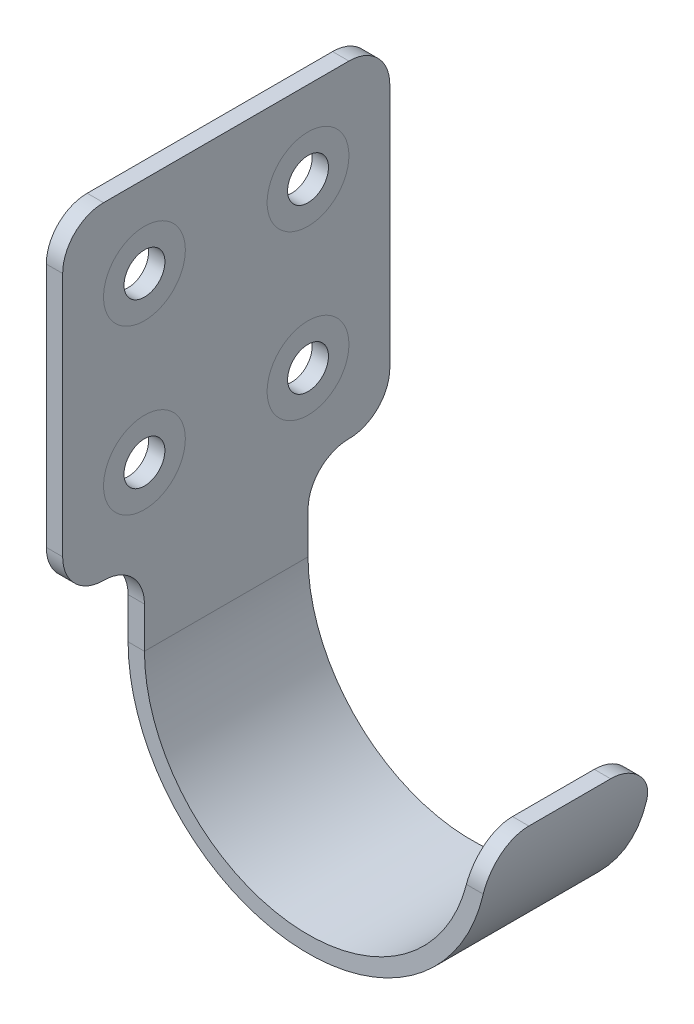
ISO-10303-21;
HEADER;
FILE_DESCRIPTION(('STEP AP214'),'2;1');
FILE_NAME('part.step','',(''),(''),'','','');
FILE_SCHEMA(('AUTOMOTIVE_DESIGN { 1 0 10303 214 1 1 1 1 }'));
ENDSEC;
DATA;
#1=APPLICATION_CONTEXT('core data for automotive mechanical design processes');
#2=APPLICATION_PROTOCOL_DEFINITION('international standard','automotive_design',2000,#1);
#3=PRODUCT_CONTEXT('',#1,'mechanical');
#4=PRODUCT('Part','Part','',(#3));
#5=PRODUCT_RELATED_PRODUCT_CATEGORY('part','',(#4));
#6=PRODUCT_DEFINITION_FORMATION('','',#4);
#7=PRODUCT_DEFINITION_CONTEXT('part definition',#1,'design');
#8=PRODUCT_DEFINITION('design','',#6,#7);
#9=PRODUCT_DEFINITION_SHAPE('','',#8);
#10=(LENGTH_UNIT() NAMED_UNIT(*) SI_UNIT(.MILLI.,.METRE.));
#11=(NAMED_UNIT(*) PLANE_ANGLE_UNIT() SI_UNIT($,.RADIAN.));
#12=(NAMED_UNIT(*) SI_UNIT($,.STERADIAN.) SOLID_ANGLE_UNIT());
#13=UNCERTAINTY_MEASURE_WITH_UNIT(LENGTH_MEASURE(1.E-05),#10,'distance_accuracy_value','');
#14=(GEOMETRIC_REPRESENTATION_CONTEXT(3) GLOBAL_UNCERTAINTY_ASSIGNED_CONTEXT((#13)) GLOBAL_UNIT_ASSIGNED_CONTEXT((#10,
#11,#12)) REPRESENTATION_CONTEXT('',''));
#15=CARTESIAN_POINT('',(0.,0.,0.));
#16=DIRECTION('',(0.,0.,1.));
#17=DIRECTION('',(1.,0.,0.));
#18=AXIS2_PLACEMENT_3D('',#15,#16,#17);
#19=CARTESIAN_POINT('',(0.,0.,20.));
#20=DIRECTION('',(1.,0.,0.));
#21=DIRECTION('',(0.,0.,-1.));
#22=AXIS2_PLACEMENT_3D('',#19,#20,#21);
#23=PLANE('',#22);
#24=CARTESIAN_POINT('',(0.,40.,20.));
#25=DIRECTION('',(1.,0.,0.));
#26=DIRECTION('',(0.,0.,-1.));
#27=AXIS2_PLACEMENT_3D('',#24,#25,#26);
#28=CIRCLE('',#27,10.);
#29=CARTESIAN_POINT('',(0.,40.,9.99999999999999));
#30=VERTEX_POINT('',#29);
#31=EDGE_CURVE('E456',#30,#30,#28,.F.);
#32=ORIENTED_EDGE('',*,*,#31,.T.);
#33=EDGE_LOOP('',(#32));
#34=FACE_BOUND('',#33,.T.);
#35=CARTESIAN_POINT('',(0.,80.,20.));
#36=DIRECTION('',(1.,0.,0.));
#37=DIRECTION('',(0.,0.,-1.));
#38=AXIS2_PLACEMENT_3D('',#35,#36,#37);
#39=CIRCLE('',#38,10.);
#40=CARTESIAN_POINT('',(0.,80.,10.));
#41=VERTEX_POINT('',#40);
#42=EDGE_CURVE('E434',#41,#41,#39,.F.);
#43=ORIENTED_EDGE('',*,*,#42,.T.);
#44=EDGE_LOOP('',(#43));
#45=FACE_BOUND('',#44,.T.);
#46=DIRECTION('',(0.,-1.,0.));
#47=VECTOR('',#46,1.);
#48=CARTESIAN_POINT('',(0.,20.,40.));
#49=LINE('',#48,#47);
#50=CARTESIAN_POINT('',(0.,90.,40.));
#51=VERTEX_POINT('',#50);
#52=CARTESIAN_POINT('',(0.,30.,40.));
#53=VERTEX_POINT('',#52);
#54=EDGE_CURVE('E381',#51,#53,#49,.T.);
#55=ORIENTED_EDGE('',*,*,#54,.T.);
#56=CARTESIAN_POINT('',(0.,30.,30.));
#57=DIRECTION('',(1.,0.,0.));
#58=DIRECTION('',(0.,0.,-1.));
#59=AXIS2_PLACEMENT_3D('',#56,#57,#58);
#60=CIRCLE('',#59,10.);
#61=CARTESIAN_POINT('',(0.,20.,30.));
#62=VERTEX_POINT('',#61);
#63=EDGE_CURVE('E386',#53,#62,#60,.T.);
#64=ORIENTED_EDGE('',*,*,#63,.T.);
#65=CARTESIAN_POINT('',(0.,10.,30.));
#66=DIRECTION('',(1.,0.,0.));
#67=DIRECTION('',(0.,0.,-1.));
#68=AXIS2_PLACEMENT_3D('',#65,#66,#67);
#69=CIRCLE('',#68,10.);
#70=CARTESIAN_POINT('',(0.,10.,20.));
#71=VERTEX_POINT('',#70);
#72=EDGE_CURVE('E161',#62,#71,#69,.F.);
#73=ORIENTED_EDGE('',*,*,#72,.T.);
#74=DIRECTION('',(0.,-1.,0.));
#75=VECTOR('',#74,1.);
#76=CARTESIAN_POINT('',(0.,0.,20.));
#77=LINE('',#76,#75);
#78=CARTESIAN_POINT('',(0.,0.,20.));
#79=VERTEX_POINT('',#78);
#80=EDGE_CURVE('E152',#71,#79,#77,.T.);
#81=ORIENTED_EDGE('',*,*,#80,.T.);
#82=DIRECTION('',(0.,0.,-1.));
#83=VECTOR('',#82,1.);
#84=CARTESIAN_POINT('',(0.,0.,20.));
#85=LINE('',#84,#83);
#86=CARTESIAN_POINT('',(0.,0.,-20.));
#87=VERTEX_POINT('',#86);
#88=EDGE_CURVE('E158',#79,#87,#85,.T.);
#89=ORIENTED_EDGE('',*,*,#88,.T.);
#90=DIRECTION('',(0.,-1.,0.));
#91=VECTOR('',#90,1.);
#92=CARTESIAN_POINT('',(0.,0.,-20.));
#93=LINE('',#92,#91);
#94=CARTESIAN_POINT('',(0.,10.,-20.));
#95=VERTEX_POINT('',#94);
#96=EDGE_CURVE('E201',#95,#87,#93,.T.);
#97=ORIENTED_EDGE('',*,*,#96,.F.);
#98=CARTESIAN_POINT('',(0.,10.,-30.));
#99=DIRECTION('',(1.,0.,0.));
#100=DIRECTION('',(0.,0.,-1.));
#101=AXIS2_PLACEMENT_3D('',#98,#99,#100);
#102=CIRCLE('',#101,10.);
#103=CARTESIAN_POINT('',(0.,20.,-30.));
#104=VERTEX_POINT('',#103);
#105=EDGE_CURVE('E428',#95,#104,#102,.F.);
#106=ORIENTED_EDGE('',*,*,#105,.T.);
#107=CARTESIAN_POINT('',(0.,30.,-30.));
#108=DIRECTION('',(1.,0.,0.));
#109=DIRECTION('',(0.,0.,-1.));
#110=AXIS2_PLACEMENT_3D('',#107,#108,#109);
#111=CIRCLE('',#110,10.);
#112=CARTESIAN_POINT('',(0.,30.,-40.));
#113=VERTEX_POINT('',#112);
#114=EDGE_CURVE('E405',#104,#113,#111,.T.);
#115=ORIENTED_EDGE('',*,*,#114,.T.);
#116=DIRECTION('',(0.,-1.,0.));
#117=VECTOR('',#116,1.);
#118=CARTESIAN_POINT('',(0.,20.,-40.));
#119=LINE('',#118,#117);
#120=CARTESIAN_POINT('',(0.,90.,-40.));
#121=VERTEX_POINT('',#120);
#122=EDGE_CURVE('E375',#121,#113,#119,.T.);
#123=ORIENTED_EDGE('',*,*,#122,.F.);
#124=CARTESIAN_POINT('',(0.,90.,-30.));
#125=DIRECTION('',(1.,0.,0.));
#126=DIRECTION('',(0.,0.,-1.));
#127=AXIS2_PLACEMENT_3D('',#124,#125,#126);
#128=CIRCLE('',#127,10.);
#129=CARTESIAN_POINT('',(0.,100.,-30.));
#130=VERTEX_POINT('',#129);
#131=EDGE_CURVE('E403',#121,#130,#128,.T.);
#132=ORIENTED_EDGE('',*,*,#131,.T.);
#133=DIRECTION('',(0.,0.,-1.));
#134=VECTOR('',#133,1.);
#135=CARTESIAN_POINT('',(0.,100.,20.));
#136=LINE('',#135,#134);
#137=CARTESIAN_POINT('',(0.,100.,30.));
#138=VERTEX_POINT('',#137);
#139=EDGE_CURVE('E183',#138,#130,#136,.T.);
#140=ORIENTED_EDGE('',*,*,#139,.F.);
#141=CARTESIAN_POINT('',(0.,90.,30.));
#142=DIRECTION('',(1.,0.,0.));
#143=DIRECTION('',(0.,0.,-1.));
#144=AXIS2_PLACEMENT_3D('',#141,#142,#143);
#145=CIRCLE('',#144,10.);
#146=EDGE_CURVE('E388',#138,#51,#145,.T.);
#147=ORIENTED_EDGE('',*,*,#146,.T.);
#148=EDGE_LOOP('',(#55,#64,#73,#81,#89,#97,#106,#115,#123,#132,#140,#147));
#149=FACE_BOUND('',#148,.T.);
#150=CARTESIAN_POINT('',(0.,80.,-20.));
#151=DIRECTION('',(1.,0.,0.));
#152=DIRECTION('',(0.,0.,-1.));
#153=AXIS2_PLACEMENT_3D('',#150,#151,#152);
#154=CIRCLE('',#153,10.);
#155=CARTESIAN_POINT('',(0.,80.,-30.));
#156=VERTEX_POINT('',#155);
#157=EDGE_CURVE('E356',#156,#156,#154,.F.);
#158=ORIENTED_EDGE('',*,*,#157,.T.);
#159=EDGE_LOOP('',(#158));
#160=FACE_BOUND('',#159,.T.);
#161=CARTESIAN_POINT('',(0.,40.,-20.));
#162=DIRECTION('',(1.,0.,0.));
#163=DIRECTION('',(0.,0.,-1.));
#164=AXIS2_PLACEMENT_3D('',#161,#162,#163);
#165=CIRCLE('',#164,10.);
#166=CARTESIAN_POINT('',(0.,40.,-30.));
#167=VERTEX_POINT('',#166);
#168=EDGE_CURVE('E12',#167,#167,#165,.F.);
#169=ORIENTED_EDGE('',*,*,#168,.T.);
#170=EDGE_LOOP('',(#169));
#171=FACE_BOUND('',#170,.T.);
#172=ADVANCED_FACE('F38',(#34,#45,#149,#160,#171),#23,.T.);
#173=CARTESIAN_POINT('',(-4.,0.,20.));
#174=DIRECTION('',(1.,0.,0.));
#175=DIRECTION('',(0.,0.,-1.));
#176=AXIS2_PLACEMENT_3D('',#173,#174,#175);
#177=PLANE('',#176);
#178=CARTESIAN_POINT('',(-4.,40.,20.));
#179=DIRECTION('',(1.,0.,0.));
#180=DIRECTION('',(0.,0.,-1.));
#181=AXIS2_PLACEMENT_3D('',#178,#179,#180);
#182=CIRCLE('',#181,10.);
#183=CARTESIAN_POINT('',(-4.,40.,9.99999999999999));
#184=VERTEX_POINT('',#183);
#185=EDGE_CURVE('E453',#184,#184,#182,.F.);
#186=ORIENTED_EDGE('',*,*,#185,.F.);
#187=EDGE_LOOP('',(#186));
#188=FACE_BOUND('',#187,.T.);
#189=CARTESIAN_POINT('',(-4.,80.,20.));
#190=DIRECTION('',(1.,0.,0.));
#191=DIRECTION('',(0.,0.,-1.));
#192=AXIS2_PLACEMENT_3D('',#189,#190,#191);
#193=CIRCLE('',#192,10.);
#194=CARTESIAN_POINT('',(-4.,80.,10.));
#195=VERTEX_POINT('',#194);
#196=EDGE_CURVE('E442',#195,#195,#193,.F.);
#197=ORIENTED_EDGE('',*,*,#196,.F.);
#198=EDGE_LOOP('',(#197));
#199=FACE_BOUND('',#198,.T.);
#200=DIRECTION('',(0.,1.,0.));
#201=VECTOR('',#200,1.);
#202=CARTESIAN_POINT('',(-4.,0.,20.));
#203=LINE('',#202,#201);
#204=CARTESIAN_POINT('',(-4.,10.,20.));
#205=VERTEX_POINT('',#204);
#206=CARTESIAN_POINT('',(-4.,0.,20.));
#207=VERTEX_POINT('',#206);
#208=EDGE_CURVE('E162',#205,#207,#203,.F.);
#209=ORIENTED_EDGE('',*,*,#208,.F.);
#210=CARTESIAN_POINT('',(-4.,10.,30.));
#211=DIRECTION('',(1.,0.,0.));
#212=DIRECTION('',(0.,0.,-1.));
#213=AXIS2_PLACEMENT_3D('',#210,#211,#212);
#214=CIRCLE('',#213,10.);
#215=CARTESIAN_POINT('',(-4.,20.,30.));
#216=VERTEX_POINT('',#215);
#217=EDGE_CURVE('E54',#205,#216,#214,.T.);
#218=ORIENTED_EDGE('',*,*,#217,.T.);
#219=CARTESIAN_POINT('',(-4.,30.,30.));
#220=DIRECTION('',(1.,0.,0.));
#221=DIRECTION('',(0.,0.,-1.));
#222=AXIS2_PLACEMENT_3D('',#219,#220,#221);
#223=CIRCLE('',#222,10.);
#224=CARTESIAN_POINT('',(-4.,30.,40.));
#225=VERTEX_POINT('',#224);
#226=EDGE_CURVE('E413',#216,#225,#223,.F.);
#227=ORIENTED_EDGE('',*,*,#226,.T.);
#228=DIRECTION('',(0.,-1.,0.));
#229=VECTOR('',#228,1.);
#230=CARTESIAN_POINT('',(-4.,20.,40.));
#231=LINE('',#230,#229);
#232=CARTESIAN_POINT('',(-4.,90.,40.));
#233=VERTEX_POINT('',#232);
#234=EDGE_CURVE('E199',#233,#225,#231,.T.);
#235=ORIENTED_EDGE('',*,*,#234,.F.);
#236=CARTESIAN_POINT('',(-4.,90.,30.));
#237=DIRECTION('',(1.,0.,0.));
#238=DIRECTION('',(0.,0.,-1.));
#239=AXIS2_PLACEMENT_3D('',#236,#237,#238);
#240=CIRCLE('',#239,10.);
#241=CARTESIAN_POINT('',(-4.,100.,30.));
#242=VERTEX_POINT('',#241);
#243=EDGE_CURVE('E399',#233,#242,#240,.F.);
#244=ORIENTED_EDGE('',*,*,#243,.T.);
#245=DIRECTION('',(0.,0.,-1.));
#246=VECTOR('',#245,1.);
#247=CARTESIAN_POINT('',(-4.,100.,20.));
#248=LINE('',#247,#246);
#249=CARTESIAN_POINT('',(-4.,100.,-30.));
#250=VERTEX_POINT('',#249);
#251=EDGE_CURVE('E206',#242,#250,#248,.T.);
#252=ORIENTED_EDGE('',*,*,#251,.T.);
#253=CARTESIAN_POINT('',(-4.,90.,-30.));
#254=DIRECTION('',(1.,0.,0.));
#255=DIRECTION('',(0.,0.,-1.));
#256=AXIS2_PLACEMENT_3D('',#253,#254,#255);
#257=CIRCLE('',#256,10.);
#258=CARTESIAN_POINT('',(-4.,90.,-40.));
#259=VERTEX_POINT('',#258);
#260=EDGE_CURVE('E409',#250,#259,#257,.F.);
#261=ORIENTED_EDGE('',*,*,#260,.T.);
#262=DIRECTION('',(0.,-1.,0.));
#263=VECTOR('',#262,1.);
#264=CARTESIAN_POINT('',(-4.,20.,-40.));
#265=LINE('',#264,#263);
#266=CARTESIAN_POINT('',(-4.,30.,-40.));
#267=VERTEX_POINT('',#266);
#268=EDGE_CURVE('E378',#259,#267,#265,.T.);
#269=ORIENTED_EDGE('',*,*,#268,.T.);
#270=CARTESIAN_POINT('',(-4.,30.,-30.));
#271=DIRECTION('',(1.,0.,0.));
#272=DIRECTION('',(0.,0.,-1.));
#273=AXIS2_PLACEMENT_3D('',#270,#271,#272);
#274=CIRCLE('',#273,10.);
#275=CARTESIAN_POINT('',(-4.,20.,-30.));
#276=VERTEX_POINT('',#275);
#277=EDGE_CURVE('E411',#267,#276,#274,.F.);
#278=ORIENTED_EDGE('',*,*,#277,.T.);
#279=CARTESIAN_POINT('',(-4.,10.,-30.));
#280=DIRECTION('',(1.,0.,0.));
#281=DIRECTION('',(0.,0.,-1.));
#282=AXIS2_PLACEMENT_3D('',#279,#280,#281);
#283=CIRCLE('',#282,10.);
#284=CARTESIAN_POINT('',(-4.,10.,-20.));
#285=VERTEX_POINT('',#284);
#286=EDGE_CURVE('E430',#276,#285,#283,.T.);
#287=ORIENTED_EDGE('',*,*,#286,.T.);
#288=DIRECTION('',(0.,1.,0.));
#289=VECTOR('',#288,1.);
#290=CARTESIAN_POINT('',(-4.,0.,-20.));
#291=LINE('',#290,#289);
#292=CARTESIAN_POINT('',(-4.,0.,-20.));
#293=VERTEX_POINT('',#292);
#294=EDGE_CURVE('E189',#285,#293,#291,.F.);
#295=ORIENTED_EDGE('',*,*,#294,.T.);
#296=DIRECTION('',(0.,0.,-1.));
#297=VECTOR('',#296,1.);
#298=CARTESIAN_POINT('',(-4.,0.,20.));
#299=LINE('',#298,#297);
#300=EDGE_CURVE('E195',#207,#293,#299,.T.);
#301=ORIENTED_EDGE('',*,*,#300,.F.);
#302=EDGE_LOOP('',(#209,#218,#227,#235,#244,#252,#261,#269,#278,#287,#295,#301));
#303=FACE_BOUND('',#302,.T.);
#304=CARTESIAN_POINT('',(-4.,80.,-20.));
#305=DIRECTION('',(1.,0.,0.));
#306=DIRECTION('',(0.,0.,-1.));
#307=AXIS2_PLACEMENT_3D('',#304,#305,#306);
#308=CIRCLE('',#307,10.);
#309=CARTESIAN_POINT('',(-4.,80.,-30.));
#310=VERTEX_POINT('',#309);
#311=EDGE_CURVE('E449',#310,#310,#308,.F.);
#312=ORIENTED_EDGE('',*,*,#311,.F.);
#313=EDGE_LOOP('',(#312));
#314=FACE_BOUND('',#313,.T.);
#315=CARTESIAN_POINT('',(-4.,40.,-20.));
#316=DIRECTION('',(1.,0.,0.));
#317=DIRECTION('',(0.,0.,-1.));
#318=AXIS2_PLACEMENT_3D('',#315,#316,#317);
#319=CIRCLE('',#318,10.);
#320=CARTESIAN_POINT('',(-4.,40.,-30.));
#321=VERTEX_POINT('',#320);
#322=EDGE_CURVE('E42',#321,#321,#319,.F.);
#323=ORIENTED_EDGE('',*,*,#322,.F.);
#324=EDGE_LOOP('',(#323));
#325=FACE_BOUND('',#324,.T.);
#326=ADVANCED_FACE('F286',(#188,#199,#303,#314,#325),#177,.F.);
#327=ORIENTED_EDGE('',*,*,#168,.F.);
#328=EDGE_LOOP('',(#327));
#329=FACE_BOUND('',#328,.T.);
#330=CARTESIAN_POINT('',(0.,40.,-20.));
#331=DIRECTION('',(1.,0.,0.));
#332=DIRECTION('',(0.,0.,-1.));
#333=AXIS2_PLACEMENT_3D('',#330,#331,#332);
#334=CIRCLE('',#333,5.);
#335=CARTESIAN_POINT('',(0.,40.,-25.));
#336=VERTEX_POINT('',#335);
#337=EDGE_CURVE('E368',#336,#336,#334,.T.);
#338=ORIENTED_EDGE('',*,*,#337,.F.);
#339=EDGE_LOOP('',(#338));
#340=FACE_BOUND('',#339,.T.);
#341=ADVANCED_FACE('F321',(#329,#340),#23,.T.);
#342=ORIENTED_EDGE('',*,*,#322,.T.);
#343=EDGE_LOOP('',(#342));
#344=FACE_BOUND('',#343,.T.);
#345=CARTESIAN_POINT('',(-4.,40.,-20.));
#346=DIRECTION('',(1.,0.,0.));
#347=DIRECTION('',(0.,0.,-1.));
#348=AXIS2_PLACEMENT_3D('',#345,#346,#347);
#349=CIRCLE('',#348,5.);
#350=CARTESIAN_POINT('',(-4.,40.,-25.));
#351=VERTEX_POINT('',#350);
#352=EDGE_CURVE('E362',#351,#351,#349,.T.);
#353=ORIENTED_EDGE('',*,*,#352,.T.);
#354=EDGE_LOOP('',(#353));
#355=FACE_BOUND('',#354,.T.);
#356=ADVANCED_FACE('F326',(#344,#355),#177,.F.);
#357=ORIENTED_EDGE('',*,*,#185,.T.);
#358=EDGE_LOOP('',(#357));
#359=FACE_BOUND('',#358,.T.);
#360=CARTESIAN_POINT('',(-4.,40.,20.));
#361=DIRECTION('',(1.,0.,0.));
#362=DIRECTION('',(0.,0.,1.));
#363=AXIS2_PLACEMENT_3D('',#360,#361,#362);
#364=CIRCLE('',#363,5.);
#365=CARTESIAN_POINT('',(-4.,40.,25.));
#366=VERTEX_POINT('',#365);
#367=EDGE_CURVE('E484',#366,#366,#364,.T.);
#368=ORIENTED_EDGE('',*,*,#367,.T.);
#369=EDGE_LOOP('',(#368));
#370=FACE_BOUND('',#369,.T.);
#371=ADVANCED_FACE('F335',(#359,#370),#177,.F.);
#372=ORIENTED_EDGE('',*,*,#31,.F.);
#373=EDGE_LOOP('',(#372));
#374=FACE_BOUND('',#373,.T.);
#375=CARTESIAN_POINT('',(0.,40.,20.));
#376=DIRECTION('',(1.,0.,0.));
#377=DIRECTION('',(0.,0.,1.));
#378=AXIS2_PLACEMENT_3D('',#375,#376,#377);
#379=CIRCLE('',#378,5.);
#380=CARTESIAN_POINT('',(0.,40.,25.));
#381=VERTEX_POINT('',#380);
#382=EDGE_CURVE('E438',#381,#381,#379,.T.);
#383=ORIENTED_EDGE('',*,*,#382,.F.);
#384=EDGE_LOOP('',(#383));
#385=FACE_BOUND('',#384,.T.);
#386=ADVANCED_FACE('F331',(#374,#385),#23,.T.);
#387=ORIENTED_EDGE('',*,*,#311,.T.);
#388=EDGE_LOOP('',(#387));
#389=FACE_BOUND('',#388,.T.);
#390=CARTESIAN_POINT('',(-4.,80.,-20.));
#391=DIRECTION('',(1.,0.,0.));
#392=DIRECTION('',(0.,0.,1.));
#393=AXIS2_PLACEMENT_3D('',#390,#391,#392);
#394=CIRCLE('',#393,5.);
#395=CARTESIAN_POINT('',(-4.,80.,-15.));
#396=VERTEX_POINT('',#395);
#397=EDGE_CURVE('E361',#396,#396,#394,.T.);
#398=ORIENTED_EDGE('',*,*,#397,.T.);
#399=EDGE_LOOP('',(#398));
#400=FACE_BOUND('',#399,.T.);
#401=ADVANCED_FACE('F287',(#389,#400),#177,.F.);
#402=ORIENTED_EDGE('',*,*,#157,.F.);
#403=EDGE_LOOP('',(#402));
#404=FACE_BOUND('',#403,.T.);
#405=CARTESIAN_POINT('',(0.,80.,-20.));
#406=DIRECTION('',(1.,0.,0.));
#407=DIRECTION('',(0.,0.,1.));
#408=AXIS2_PLACEMENT_3D('',#405,#406,#407);
#409=CIRCLE('',#408,5.);
#410=CARTESIAN_POINT('',(0.,80.,-15.));
#411=VERTEX_POINT('',#410);
#412=EDGE_CURVE('E359',#411,#411,#409,.T.);
#413=ORIENTED_EDGE('',*,*,#412,.F.);
#414=EDGE_LOOP('',(#413));
#415=FACE_BOUND('',#414,.T.);
#416=ADVANCED_FACE('F278',(#404,#415),#23,.T.);
#417=CARTESIAN_POINT('',(40.,0.,-20.));
#418=DIRECTION('',(0.,0.,1.));
#419=DIRECTION('',(1.,0.,0.));
#420=AXIS2_PLACEMENT_3D('',#417,#418,#419);
#421=PLANE('',#420);
#422=ORIENTED_EDGE('',*,*,#294,.F.);
#423=DIRECTION('',(1.,0.,0.));
#424=VECTOR('',#423,1.);
#425=CARTESIAN_POINT('',(0.,10.,-20.));
#426=LINE('',#425,#424);
#427=EDGE_CURVE('E425',#285,#95,#426,.T.);
#428=ORIENTED_EDGE('',*,*,#427,.T.);
#429=ORIENTED_EDGE('',*,*,#96,.T.);
#430=DIRECTION('',(-1.,0.,0.));
#431=VECTOR('',#430,1.);
#432=CARTESIAN_POINT('',(0.,0.,-20.));
#433=LINE('',#432,#431);
#434=EDGE_CURVE('E173',#87,#293,#433,.T.);
#435=ORIENTED_EDGE('',*,*,#434,.T.);
#436=EDGE_LOOP('',(#422,#428,#429,#435));
#437=FACE_BOUND('',#436,.T.);
#438=ADVANCED_FACE('F249',(#437),#421,.F.);
#439=CARTESIAN_POINT('',(-4.,0.,20.));
#440=DIRECTION('',(0.,0.,1.));
#441=DIRECTION('',(1.,0.,0.));
#442=AXIS2_PLACEMENT_3D('',#439,#440,#441);
#443=PLANE('',#442);
#444=CARTESIAN_POINT('',(40.,0.,20.));
#445=DIRECTION('',(0.,0.,1.));
#446=DIRECTION('',(1.,0.,0.));
#447=AXIS2_PLACEMENT_3D('',#444,#445,#446);
#448=CIRCLE('',#447,44.);
#449=CARTESIAN_POINT('',(82.8485705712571,-10.,20.));
#450=VERTEX_POINT('',#449);
#451=EDGE_CURVE('E188',#207,#450,#448,.T.);
#452=ORIENTED_EDGE('',*,*,#451,.T.);
#453=DIRECTION('',(1.,0.,0.));
#454=VECTOR('',#453,1.);
#455=CARTESIAN_POINT('',(-4.,-10.,20.));
#456=LINE('',#455,#454);
#457=CARTESIAN_POINT('',(78.7298334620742,-10.,20.));
#458=VERTEX_POINT('',#457);
#459=EDGE_CURVE('E187',#450,#458,#456,.F.);
#460=ORIENTED_EDGE('',*,*,#459,.T.);
#461=CARTESIAN_POINT('',(40.,0.,20.));
#462=DIRECTION('',(0.,0.,1.));
#463=DIRECTION('',(1.,0.,0.));
#464=AXIS2_PLACEMENT_3D('',#461,#462,#463);
#465=CIRCLE('',#464,40.);
#466=EDGE_CURVE('E163',#79,#458,#465,.T.);
#467=ORIENTED_EDGE('',*,*,#466,.F.);
#468=DIRECTION('',(1.,0.,0.));
#469=VECTOR('',#468,1.);
#470=CARTESIAN_POINT('',(-4.,0.,20.));
#471=LINE('',#470,#469);
#472=EDGE_CURVE('E166',#207,#79,#471,.T.);
#473=ORIENTED_EDGE('',*,*,#472,.F.);
#474=EDGE_LOOP('',(#452,#460,#467,#473));
#475=FACE_BOUND('',#474,.T.);
#476=ADVANCED_FACE('F185',(#475),#443,.T.);
#477=CARTESIAN_POINT('',(0.,0.,-20.));
#478=DIRECTION('',(0.,0.,-1.));
#479=DIRECTION('',(-1.,0.,0.));
#480=AXIS2_PLACEMENT_3D('',#477,#478,#479);
#481=PLANE('',#480);
#482=CARTESIAN_POINT('',(40.,0.,-20.));
#483=DIRECTION('',(0.,0.,1.));
#484=DIRECTION('',(1.,0.,0.));
#485=AXIS2_PLACEMENT_3D('',#482,#483,#484);
#486=CIRCLE('',#485,40.);
#487=CARTESIAN_POINT('',(78.7298334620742,-10.,-20.));
#488=VERTEX_POINT('',#487);
#489=EDGE_CURVE('E181',#87,#488,#486,.T.);
#490=ORIENTED_EDGE('',*,*,#489,.T.);
#491=DIRECTION('',(1.,0.,0.));
#492=VECTOR('',#491,1.);
#493=CARTESIAN_POINT('',(0.,-10.,-20.));
#494=LINE('',#493,#492);
#495=CARTESIAN_POINT('',(82.8485705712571,-10.,-20.));
#496=VERTEX_POINT('',#495);
#497=EDGE_CURVE('E172',#488,#496,#494,.T.);
#498=ORIENTED_EDGE('',*,*,#497,.T.);
#499=CARTESIAN_POINT('',(40.,0.,-20.));
#500=DIRECTION('',(0.,0.,1.));
#501=DIRECTION('',(1.,0.,0.));
#502=AXIS2_PLACEMENT_3D('',#499,#500,#501);
#503=CIRCLE('',#502,44.);
#504=EDGE_CURVE('E196',#293,#496,#503,.T.);
#505=ORIENTED_EDGE('',*,*,#504,.F.);
#506=ORIENTED_EDGE('',*,*,#434,.F.);
#507=EDGE_LOOP('',(#490,#498,#505,#506));
#508=FACE_BOUND('',#507,.T.);
#509=ADVANCED_FACE('F241',(#508),#481,.T.);
#510=CARTESIAN_POINT('',(40.,0.,20.));
#511=DIRECTION('',(0.,0.,-1.));
#512=DIRECTION('',(-1.,0.,0.));
#513=AXIS2_PLACEMENT_3D('',#510,#511,#512);
#514=CYLINDRICAL_SURFACE('',#513,44.);
#515=ORIENTED_EDGE('',*,*,#504,.T.);
#516=CARTESIAN_POINT('',(82.8485705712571,-10.,-20.));
#517=CARTESIAN_POINT('',(82.9123617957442,-9.72677693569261,-20.000031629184));
#518=CARTESIAN_POINT('',(82.9734946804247,-9.4529138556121,-19.9888031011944));
#519=CARTESIAN_POINT('',(83.090182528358,-8.90582970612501,-19.9437400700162));
#520=CARTESIAN_POINT('',(83.145736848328,-8.63260871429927,-19.9099029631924));
#521=CARTESIAN_POINT('',(83.250971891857,-8.08889596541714,-19.8195539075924));
#522=CARTESIAN_POINT('',(83.3006547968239,-7.81840322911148,-19.7630504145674));
#523=CARTESIAN_POINT('',(83.3940698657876,-7.28208403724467,-19.6275342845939));
#524=CARTESIAN_POINT('',(83.4378024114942,-7.01625728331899,-19.5485230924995));
#525=CARTESIAN_POINT('',(83.5194044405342,-6.49093253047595,-19.3682265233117));
#526=CARTESIAN_POINT('',(83.5572659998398,-6.2314434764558,-19.2669114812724));
#527=CARTESIAN_POINT('',(83.6272204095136,-5.72118508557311,-19.0426437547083));
#528=CARTESIAN_POINT('',(83.6593133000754,-5.47041568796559,-18.9196912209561));
#529=CARTESIAN_POINT('',(83.7180057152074,-4.97966190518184,-18.6529859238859));
#530=CARTESIAN_POINT('',(83.7446075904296,-4.73967293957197,-18.5092421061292));
#531=CARTESIAN_POINT('',(83.7927298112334,-4.2722392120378,-18.2018896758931));
#532=CARTESIAN_POINT('',(83.814250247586,-4.04479422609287,-18.0382814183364));
#533=CARTESIAN_POINT('',(83.8524365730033,-3.60713560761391,-17.6946514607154));
#534=CARTESIAN_POINT('',(83.8691632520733,-3.39673294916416,-17.5148771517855));
#535=CARTESIAN_POINT('',(83.8986649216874,-2.9914074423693,-17.1383572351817));
#536=CARTESIAN_POINT('',(83.9114399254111,-2.79648454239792,-16.9416116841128));
#537=CARTESIAN_POINT('',(83.9336047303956,-2.42348954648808,-16.5324683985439));
#538=CARTESIAN_POINT('',(83.9429935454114,-2.24542237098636,-16.3200661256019));
#539=CARTESIAN_POINT('',(83.9589594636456,-1.90748711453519,-15.8811519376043));
#540=CARTESIAN_POINT('',(83.9655365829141,-1.74761892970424,-15.6546401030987));
#541=CARTESIAN_POINT('',(83.9764807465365,-1.44637369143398,-15.1877820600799));
#542=CARTESIAN_POINT('',(83.9808351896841,-1.30510536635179,-14.9473653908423));
#543=CARTESIAN_POINT('',(83.9878286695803,-1.04312350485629,-14.4555584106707));
#544=CARTESIAN_POINT('',(83.9904676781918,-0.922410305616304,-14.2041679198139));
#545=CARTESIAN_POINT('',(83.9945304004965,-0.702432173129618,-13.6922607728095));
#546=CARTESIAN_POINT('',(83.9959545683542,-0.603159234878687,-13.4317475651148));
#547=CARTESIAN_POINT('',(83.9980187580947,-0.426723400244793,-12.9034436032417));
#548=CARTESIAN_POINT('',(83.9986589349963,-0.349556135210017,-12.6356542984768));
#549=CARTESIAN_POINT('',(83.9996950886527,-0.189542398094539,-11.9781814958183));
#550=CARTESIAN_POINT('',(83.9998681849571,-0.118484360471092,-11.5855303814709));
#551=CARTESIAN_POINT('',(83.9999797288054,-0.0474147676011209,-10.9928250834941));
#552=CARTESIAN_POINT('',(83.9999922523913,-0.0296444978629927,-10.7947190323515));
#553=CARTESIAN_POINT('',(84.0000005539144,-0.00593741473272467,-10.3977617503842));
#554=CARTESIAN_POINT('',(83.9999963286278,-2.87974221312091E-06,-10.1989103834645));
#555=CARTESIAN_POINT('',(84.,0.,-10.));
#556=B_SPLINE_CURVE_WITH_KNOTS('',3,(#516,#517,#518,#519,#520,#521,#522,#523,#524,#525,#526,
#527,#528,#529,#530,#531,#532,#533,#534,#535,#536,#537,#538,#539,#540,#541,#542,#543,#544,#545,
#546,#547,#548,#549,#550,#551,#552,#553,#554,#555),.UNSPECIFIED.,.F.,.F.,(4,2,2,2,2,2,2,2,2,2,2,
2,2,2,2,2,2,2,2,4),(0.,0.84150358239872,1.68310409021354,2.5243909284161,3.36562377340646,
4.20798232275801,5.05033500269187,5.89232632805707,6.73430261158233,7.56507446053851,
8.3958435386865,9.22685438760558,10.0578604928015,10.8935269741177,11.7292071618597,
12.5645747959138,13.3997772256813,14.5935969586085,15.1900070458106,15.7865319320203),.UNSPECIFIED.);
#557=CARTESIAN_POINT('',(84.,0.,-10.));
#558=VERTEX_POINT('',#557);
#559=EDGE_CURVE('E226',#496,#558,#556,.T.);
#560=ORIENTED_EDGE('',*,*,#559,.T.);
#561=DIRECTION('',(0.,0.,-1.));
#562=VECTOR('',#561,1.);
#563=CARTESIAN_POINT('',(84.,0.,20.));
#564=LINE('',#563,#562);
#565=CARTESIAN_POINT('',(84.,0.,10.));
#566=VERTEX_POINT('',#565);
#567=EDGE_CURVE('E212',#566,#558,#564,.T.);
#568=ORIENTED_EDGE('',*,*,#567,.F.);
#569=CARTESIAN_POINT('',(84.,0.,10.));
#570=CARTESIAN_POINT('',(83.9999797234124,3.01818590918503E-05,10.2811167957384));
#571=CARTESIAN_POINT('',(83.9999993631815,-0.0118527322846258,10.5622292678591));
#572=CARTESIAN_POINT('',(83.9999719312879,-0.0592268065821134,11.1224455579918));
#573=CARTESIAN_POINT('',(83.9999248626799,-0.0947168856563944,11.4015494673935));
#574=CARTESIAN_POINT('',(83.9996175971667,-0.18905597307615,11.9555902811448));
#575=CARTESIAN_POINT('',(83.999357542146,-0.247889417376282,12.2305298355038));
#576=CARTESIAN_POINT('',(83.9983414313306,-0.388487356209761,12.7744772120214));
#577=CARTESIAN_POINT('',(83.9975853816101,-0.470251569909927,13.0434851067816));
#578=CARTESIAN_POINT('',(83.995204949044,-0.656180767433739,13.573798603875));
#579=CARTESIAN_POINT('',(83.993580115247,-0.760357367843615,13.8351001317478));
#580=CARTESIAN_POINT('',(83.9890036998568,-0.99034113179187,14.3479918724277));
#581=CARTESIAN_POINT('',(83.9860521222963,-1.11614822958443,14.5995821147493));
#582=CARTESIAN_POINT('',(83.9782980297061,-1.38846797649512,15.0912148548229));
#583=CARTESIAN_POINT('',(83.9734958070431,-1.53497735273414,15.3312591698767));
#584=CARTESIAN_POINT('',(83.9614676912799,-1.84765395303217,15.7981189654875));
#585=CARTESIAN_POINT('',(83.954241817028,-2.01382102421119,16.0249345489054));
#586=CARTESIAN_POINT('',(83.9367860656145,-2.3642171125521,16.4632321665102));
#587=CARTESIAN_POINT('',(83.9265626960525,-2.54840643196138,16.6747461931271));
#588=CARTESIAN_POINT('',(83.902507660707,-2.93378293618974,17.0814587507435));
#589=CARTESIAN_POINT('',(83.8886759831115,-3.13497017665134,17.27665722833));
#590=CARTESIAN_POINT('',(83.8568272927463,-3.55282877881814,17.6493369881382));
#591=CARTESIAN_POINT('',(83.838810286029,-3.76950011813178,17.8268182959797));
#592=CARTESIAN_POINT('',(83.7980603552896,-4.21666943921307,18.1627995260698));
#593=CARTESIAN_POINT('',(83.7753275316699,-4.4471671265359,18.3212998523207));
#594=CARTESIAN_POINT('',(83.7249084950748,-4.91812517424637,18.6169113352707));
#595=CARTESIAN_POINT('',(83.6972677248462,-5.1584797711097,18.7541987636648));
#596=CARTESIAN_POINT('',(83.6365420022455,-5.64918781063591,19.0081497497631));
#597=CARTESIAN_POINT('',(83.6034570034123,-5.89954133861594,19.124813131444));
#598=CARTESIAN_POINT('',(83.5315928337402,-6.40830534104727,19.3367896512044));
#599=CARTESIAN_POINT('',(83.492814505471,-6.66671461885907,19.4321059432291));
#600=CARTESIAN_POINT('',(83.4094515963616,-7.18955278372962,19.6008798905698));
#601=CARTESIAN_POINT('',(83.3648681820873,-7.45398045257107,19.6743419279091));
#602=CARTESIAN_POINT('',(83.2504071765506,-8.09613501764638,19.8246564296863));
#603=CARTESIAN_POINT('',(83.1776406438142,-8.4759821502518,19.8906148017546));
#604=CARTESIAN_POINT('',(83.06024811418,-9.04726202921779,19.9563583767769));
#605=CARTESIAN_POINT('',(83.0197719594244,-9.2378180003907,19.9727406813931));
#606=CARTESIAN_POINT('',(82.9361496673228,-9.61899873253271,19.994560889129));
#607=CARTESIAN_POINT('',(82.8930031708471,-9.80962349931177,19.9999973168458));
#608=CARTESIAN_POINT('',(82.8485705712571,-10.,20.));
#609=B_SPLINE_CURVE_WITH_KNOTS('',3,(#569,#570,#571,#572,#573,#574,#575,#576,#577,#578,#579,
#580,#581,#582,#583,#584,#585,#586,#587,#588,#589,#590,#591,#592,#593,#594,#595,#596,#597,#598,
#599,#600,#601,#602,#603,#604,#605,#606,#607,#608),.UNSPECIFIED.,.F.,.F.,(4,2,2,2,2,2,2,2,2,2,2,
2,2,2,2,2,2,2,2,4),(0.,0.843093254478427,1.68614790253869,2.52864139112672,3.37112456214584,
4.21404545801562,5.05696379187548,5.89974901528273,6.74252768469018,7.58349005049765,
8.42445516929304,9.26541907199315,10.1063650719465,10.9398962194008,11.7734344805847,
12.6068495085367,13.440097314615,14.6140255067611,15.2002412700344,15.786536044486),.UNSPECIFIED.);
#610=EDGE_CURVE('E219',#566,#450,#609,.T.);
#611=ORIENTED_EDGE('',*,*,#610,.T.);
#612=ORIENTED_EDGE('',*,*,#451,.F.);
#613=ORIENTED_EDGE('',*,*,#300,.T.);
#614=EDGE_LOOP('',(#515,#560,#568,#611,#612,#613));
#615=FACE_BOUND('',#614,.T.);
#616=ADVANCED_FACE('F235',(#615),#514,.T.);
#617=CARTESIAN_POINT('',(80.,0.,20.));
#618=DIRECTION('',(0.,1.,0.));
#619=DIRECTION('',(0.,0.,1.));
#620=AXIS2_PLACEMENT_3D('',#617,#618,#619);
#621=PLANE('',#620);
#622=ORIENTED_EDGE('',*,*,#567,.T.);
#623=DIRECTION('',(1.,0.,0.));
#624=VECTOR('',#623,1.);
#625=CARTESIAN_POINT('',(80.,0.,-10.));
#626=LINE('',#625,#624);
#627=CARTESIAN_POINT('',(80.,0.,-10.));
#628=VERTEX_POINT('',#627);
#629=EDGE_CURVE('E522',#558,#628,#626,.F.);
#630=ORIENTED_EDGE('',*,*,#629,.T.);
#631=DIRECTION('',(0.,0.,-1.));
#632=VECTOR('',#631,1.);
#633=CARTESIAN_POINT('',(80.,0.,20.));
#634=LINE('',#633,#632);
#635=CARTESIAN_POINT('',(80.,0.,10.));
#636=VERTEX_POINT('',#635);
#637=EDGE_CURVE('E182',#636,#628,#634,.T.);
#638=ORIENTED_EDGE('',*,*,#637,.F.);
#639=DIRECTION('',(1.,0.,0.));
#640=VECTOR('',#639,1.);
#641=CARTESIAN_POINT('',(80.,0.,10.));
#642=LINE('',#641,#640);
#643=EDGE_CURVE('E524',#636,#566,#642,.T.);
#644=ORIENTED_EDGE('',*,*,#643,.T.);
#645=EDGE_LOOP('',(#622,#630,#638,#644));
#646=FACE_BOUND('',#645,.T.);
#647=ADVANCED_FACE('F240',(#646),#621,.T.);
#648=CARTESIAN_POINT('',(40.,0.,20.));
#649=DIRECTION('',(0.,0.,-1.));
#650=DIRECTION('',(-1.,0.,0.));
#651=AXIS2_PLACEMENT_3D('',#648,#649,#650);
#652=CYLINDRICAL_SURFACE('',#651,40.);
#653=ORIENTED_EDGE('',*,*,#637,.T.);
#654=CARTESIAN_POINT('',(80.,0.,-10.));
#655=CARTESIAN_POINT('',(79.9999777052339,3.01688607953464E-05,-10.2810865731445));
#656=CARTESIAN_POINT('',(79.9999992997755,-0.011850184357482,-10.5621688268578));
#657=CARTESIAN_POINT('',(79.9999691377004,-0.0592140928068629,-11.1223254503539));
#658=CARTESIAN_POINT('',(79.9999173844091,-0.0946965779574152,-11.4013999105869));
#659=CARTESIAN_POINT('',(79.9995795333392,-0.189016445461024,-11.9553884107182));
#660=CARTESIAN_POINT('',(79.9992935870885,-0.24783871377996,-12.2303050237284));
#661=CARTESIAN_POINT('',(79.9981762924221,-0.388410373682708,-12.7742079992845));
#662=CARTESIAN_POINT('',(79.9973449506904,-0.470159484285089,-13.0431944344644));
#663=CARTESIAN_POINT('',(79.9947274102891,-0.656055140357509,-13.573468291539));
#664=CARTESIAN_POINT('',(79.9929407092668,-0.760213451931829,-13.834751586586));
#665=CARTESIAN_POINT('',(79.9879082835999,-0.990156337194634,-14.3476073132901));
#666=CARTESIAN_POINT('',(79.9846625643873,-1.11594083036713,-14.5991797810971));
#667=CARTESIAN_POINT('',(79.9761355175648,-1.38820974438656,-15.090776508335));
#668=CARTESIAN_POINT('',(79.9708545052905,-1.53469095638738,-15.3308025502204));
#669=CARTESIAN_POINT('',(79.9576268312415,-1.8473012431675,-15.7976212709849));
#670=CARTESIAN_POINT('',(79.9496801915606,-2.01343015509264,-16.0244140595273));
#671=CARTESIAN_POINT('',(79.9304871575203,-2.36365386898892,-16.4625590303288));
#672=CARTESIAN_POINT('',(79.9192494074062,-2.54770077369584,-16.6739498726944));
#673=CARTESIAN_POINT('',(79.8928090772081,-2.93274815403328,-17.080418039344));
#674=CARTESIAN_POINT('',(79.8776064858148,-3.13374867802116,-17.2754953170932));
#675=CARTESIAN_POINT('',(79.8426038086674,-3.55116497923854,-17.6479250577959));
#676=CARTESIAN_POINT('',(79.8228039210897,-3.76758009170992,-17.825278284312));
#677=CARTESIAN_POINT('',(79.7780247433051,-4.21415380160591,-18.1610058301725));
#678=CARTESIAN_POINT('',(79.7530455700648,-4.44431208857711,-18.3193805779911));
#679=CARTESIAN_POINT('',(79.6977011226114,-4.91404549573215,-18.6144747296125));
#680=CARTESIAN_POINT('',(79.6673961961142,-5.1534938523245,-18.7514072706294));
#681=CARTESIAN_POINT('',(79.6008357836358,-5.64221820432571,-19.0047489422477));
#682=CARTESIAN_POINT('',(79.5645802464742,-5.8914942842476,-19.1211578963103));
#683=CARTESIAN_POINT('',(79.4858469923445,-6.39793016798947,-19.332758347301));
#684=CARTESIAN_POINT('',(79.4433697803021,-6.6550893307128,-19.4279515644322));
#685=CARTESIAN_POINT('',(79.3520772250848,-7.17522271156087,-19.5966364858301));
#686=CARTESIAN_POINT('',(79.3032631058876,-7.43819579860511,-19.6701323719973));
#687=CARTESIAN_POINT('',(79.1768979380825,-8.0820331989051,-19.8220504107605));
#688=CARTESIAN_POINT('',(79.096007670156,-8.46503304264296,-19.8890370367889));
#689=CARTESIAN_POINT('',(78.9654275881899,-9.04070248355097,-19.9557575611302));
#690=CARTESIAN_POINT('',(78.920392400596,-9.23266202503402,-19.972371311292));
#691=CARTESIAN_POINT('',(78.8273298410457,-9.61652061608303,-19.9944917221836));
#692=CARTESIAN_POINT('',(78.7793021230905,-9.80841965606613,-19.9999970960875));
#693=CARTESIAN_POINT('',(78.7298334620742,-10.,-20.));
#694=B_SPLINE_CURVE_WITH_KNOTS('',3,(#654,#655,#656,#657,#658,#659,#660,#661,#662,#663,#664,
#665,#666,#667,#668,#669,#670,#671,#672,#673,#674,#675,#676,#677,#678,#679,#680,#681,#682,#683,
#684,#685,#686,#687,#688,#689,#690,#691,#692,#693),.UNSPECIFIED.,.F.,.F.,(4,2,2,2,2,2,2,2,2,2,2,
2,2,2,2,2,2,2,2,4),(0.,0.843002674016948,1.68596713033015,2.52838660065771,3.37079574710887,
4.21364829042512,5.05649769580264,5.89921656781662,6.74192845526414,7.58244647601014,
8.42296689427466,9.26345108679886,10.1039163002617,10.9354088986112,11.7669086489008,
12.5983409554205,13.4296129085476,14.6178240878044,15.2111584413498,15.8045615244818),.UNSPECIFIED.);
#695=EDGE_CURVE('E257',#628,#488,#694,.T.);
#696=ORIENTED_EDGE('',*,*,#695,.T.);
#697=ORIENTED_EDGE('',*,*,#489,.F.);
#698=ORIENTED_EDGE('',*,*,#88,.F.);
#699=ORIENTED_EDGE('',*,*,#466,.T.);
#700=CARTESIAN_POINT('',(78.7298334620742,-10.,20.));
#701=CARTESIAN_POINT('',(78.7999678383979,-9.72848259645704,20.0000318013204));
#702=CARTESIAN_POINT('',(78.867199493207,-9.45619134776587,19.9889423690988));
#703=CARTESIAN_POINT('',(78.9955695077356,-8.91196597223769,19.9443736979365));
#704=CARTESIAN_POINT('',(79.0567069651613,-8.64003190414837,19.9108911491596));
#705=CARTESIAN_POINT('',(79.1725630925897,-8.09858530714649,19.8214017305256));
#706=CARTESIAN_POINT('',(79.2272836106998,-7.82907210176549,19.7654013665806));
#707=CARTESIAN_POINT('',(79.3302066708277,-7.29444338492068,19.6309874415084));
#708=CARTESIAN_POINT('',(79.3784096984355,-7.02932754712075,19.552575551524));
#709=CARTESIAN_POINT('',(79.4683937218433,-6.50513182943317,19.3735118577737));
#710=CARTESIAN_POINT('',(79.510164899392,-6.24606167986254,19.2728266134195));
#711=CARTESIAN_POINT('',(79.5873695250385,-5.73642754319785,19.0498238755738));
#712=CARTESIAN_POINT('',(79.6228030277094,-5.48586348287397,18.9275065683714));
#713=CARTESIAN_POINT('',(79.6876253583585,-4.99535539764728,18.6620586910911));
#714=CARTESIAN_POINT('',(79.7170171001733,-4.75540629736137,18.5189382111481));
#715=CARTESIAN_POINT('',(79.7702049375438,-4.28790795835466,18.2127992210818));
#716=CARTESIAN_POINT('',(79.7940011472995,-4.0603584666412,18.0497811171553));
#717=CARTESIAN_POINT('',(79.836183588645,-3.62298006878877,17.7077526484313));
#718=CARTESIAN_POINT('',(79.8546504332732,-3.41292556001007,17.5290405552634));
#719=CARTESIAN_POINT('',(79.8872467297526,-3.00812083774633,17.154692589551));
#720=CARTESIAN_POINT('',(79.9013762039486,-2.81337054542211,16.9590568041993));
#721=CARTESIAN_POINT('',(79.9259144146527,-2.44054918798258,16.552165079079));
#722=CARTESIAN_POINT('',(79.9363219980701,-2.26248330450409,16.3409043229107));
#723=CARTESIAN_POINT('',(79.9540411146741,-1.92438685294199,15.9042957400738));
#724=CARTESIAN_POINT('',(79.9613526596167,-1.76435621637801,15.678947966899));
#725=CARTESIAN_POINT('',(79.9735432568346,-1.46247132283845,15.2142007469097));
#726=CARTESIAN_POINT('',(79.9784058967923,-1.32074431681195,14.9747182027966));
#727=CARTESIAN_POINT('',(79.9862293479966,-1.05772371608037,14.4847538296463));
#728=CARTESIAN_POINT('',(79.9891901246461,-0.936430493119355,14.2342718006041));
#729=CARTESIAN_POINT('',(79.9937593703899,-0.715171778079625,13.7241388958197));
#730=CARTESIAN_POINT('',(79.9953683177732,-0.615198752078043,13.4644912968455));
#731=CARTESIAN_POINT('',(79.9977086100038,-0.437247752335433,12.9378689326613));
#732=CARTESIAN_POINT('',(79.9984401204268,-0.359265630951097,12.6708955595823));
#733=CARTESIAN_POINT('',(79.999643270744,-0.195466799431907,12.0085672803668));
#734=CARTESIAN_POINT('',(79.999845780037,-0.122191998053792,11.6100007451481));
#735=CARTESIAN_POINT('',(79.9999762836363,-0.0489006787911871,11.0082290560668));
#736=CARTESIAN_POINT('',(79.9999909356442,-0.0305737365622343,10.8070626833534));
#737=CARTESIAN_POINT('',(80.0000006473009,-0.0061238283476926,10.4039517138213));
#738=CARTESIAN_POINT('',(79.9999957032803,-3.14829302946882E-06,10.2020069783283));
#739=CARTESIAN_POINT('',(80.,0.,10.));
#740=B_SPLINE_CURVE_WITH_KNOTS('',3,(#700,#701,#702,#703,#704,#705,#706,#707,#708,#709,#710,
#711,#712,#713,#714,#715,#716,#717,#718,#719,#720,#721,#722,#723,#724,#725,#726,#727,#728,#729,
#730,#731,#732,#733,#734,#735,#736,#737,#738,#739),.UNSPECIFIED.,.F.,.F.,(4,2,2,2,2,2,2,2,2,2,2,
2,2,2,2,2,2,2,2,4),(0.,0.841086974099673,1.6822982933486,2.52326674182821,3.36417249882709,
4.20634944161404,5.0485191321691,5.890281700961,6.73202708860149,7.56027825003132,
8.38852514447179,9.21702841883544,10.0455285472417,10.8795096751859,11.7135059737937,
12.5472070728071,13.3807508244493,14.5930601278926,15.1987507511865,15.8045547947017),.UNSPECIFIED.);
#741=EDGE_CURVE('E263',#458,#636,#740,.T.);
#742=ORIENTED_EDGE('',*,*,#741,.T.);
#743=EDGE_LOOP('',(#653,#696,#697,#698,#699,#742));
#744=FACE_BOUND('',#743,.T.);
#745=ADVANCED_FACE('F178',(#744),#652,.F.);
#746=ORIENTED_EDGE('',*,*,#42,.F.);
#747=EDGE_LOOP('',(#746));
#748=FACE_BOUND('',#747,.T.);
#749=CARTESIAN_POINT('',(0.,80.,20.));
#750=DIRECTION('',(1.,0.,0.));
#751=DIRECTION('',(0.,0.,-1.));
#752=AXIS2_PLACEMENT_3D('',#749,#750,#751);
#753=CIRCLE('',#752,5.);
#754=CARTESIAN_POINT('',(0.,80.,15.));
#755=VERTEX_POINT('',#754);
#756=EDGE_CURVE('E365',#755,#755,#753,.T.);
#757=ORIENTED_EDGE('',*,*,#756,.F.);
#758=EDGE_LOOP('',(#757));
#759=FACE_BOUND('',#758,.T.);
#760=ADVANCED_FACE('F272',(#748,#759),#23,.T.);
#761=CARTESIAN_POINT('',(-4.,100.,20.));
#762=DIRECTION('',(0.,1.,0.));
#763=DIRECTION('',(0.,0.,1.));
#764=AXIS2_PLACEMENT_3D('',#761,#762,#763);
#765=PLANE('',#764);
#766=ORIENTED_EDGE('',*,*,#139,.T.);
#767=DIRECTION('',(1.,0.,0.));
#768=VECTOR('',#767,1.);
#769=CARTESIAN_POINT('',(-4.,100.,-30.));
#770=LINE('',#769,#768);
#771=EDGE_CURVE('E423',#130,#250,#770,.F.);
#772=ORIENTED_EDGE('',*,*,#771,.T.);
#773=ORIENTED_EDGE('',*,*,#251,.F.);
#774=DIRECTION('',(1.,0.,0.));
#775=VECTOR('',#774,1.);
#776=CARTESIAN_POINT('',(-4.,100.,30.));
#777=LINE('',#776,#775);
#778=EDGE_CURVE('E421',#242,#138,#777,.T.);
#779=ORIENTED_EDGE('',*,*,#778,.T.);
#780=EDGE_LOOP('',(#766,#772,#773,#779));
#781=FACE_BOUND('',#780,.T.);
#782=ADVANCED_FACE('F276',(#781),#765,.T.);
#783=ORIENTED_EDGE('',*,*,#196,.T.);
#784=EDGE_LOOP('',(#783));
#785=FACE_BOUND('',#784,.T.);
#786=CARTESIAN_POINT('',(-4.,80.,20.));
#787=DIRECTION('',(1.,0.,0.));
#788=DIRECTION('',(0.,0.,-1.));
#789=AXIS2_PLACEMENT_3D('',#786,#787,#788);
#790=CIRCLE('',#789,5.);
#791=CARTESIAN_POINT('',(-4.,80.,15.));
#792=VERTEX_POINT('',#791);
#793=EDGE_CURVE('E372',#792,#792,#790,.T.);
#794=ORIENTED_EDGE('',*,*,#793,.T.);
#795=EDGE_LOOP('',(#794));
#796=FACE_BOUND('',#795,.T.);
#797=ADVANCED_FACE('F281',(#785,#796),#177,.F.);
#798=CARTESIAN_POINT('',(40.,0.,20.));
#799=DIRECTION('',(0.,0.,1.));
#800=DIRECTION('',(1.,0.,0.));
#801=AXIS2_PLACEMENT_3D('',#798,#799,#800);
#802=PLANE('',#801);
#803=ORIENTED_EDGE('',*,*,#80,.F.);
#804=DIRECTION('',(1.,0.,0.));
#805=VECTOR('',#804,1.);
#806=CARTESIAN_POINT('',(-4.,10.,20.));
#807=LINE('',#806,#805);
#808=EDGE_CURVE('E62',#71,#205,#807,.F.);
#809=ORIENTED_EDGE('',*,*,#808,.T.);
#810=ORIENTED_EDGE('',*,*,#208,.T.);
#811=ORIENTED_EDGE('',*,*,#472,.T.);
#812=EDGE_LOOP('',(#803,#809,#810,#811));
#813=FACE_BOUND('',#812,.T.);
#814=ADVANCED_FACE('F167',(#813),#802,.T.);
#815=CARTESIAN_POINT('',(-4.,20.,40.));
#816=DIRECTION('',(0.,0.,1.));
#817=DIRECTION('',(1.,0.,0.));
#818=AXIS2_PLACEMENT_3D('',#815,#816,#817);
#819=PLANE('',#818);
#820=ORIENTED_EDGE('',*,*,#234,.T.);
#821=DIRECTION('',(1.,0.,0.));
#822=VECTOR('',#821,1.);
#823=CARTESIAN_POINT('',(-4.,30.,40.));
#824=LINE('',#823,#822);
#825=EDGE_CURVE('E394',#225,#53,#824,.T.);
#826=ORIENTED_EDGE('',*,*,#825,.T.);
#827=ORIENTED_EDGE('',*,*,#54,.F.);
#828=DIRECTION('',(1.,0.,0.));
#829=VECTOR('',#828,1.);
#830=CARTESIAN_POINT('',(-4.,90.,40.));
#831=LINE('',#830,#829);
#832=EDGE_CURVE('E391',#51,#233,#831,.F.);
#833=ORIENTED_EDGE('',*,*,#832,.T.);
#834=EDGE_LOOP('',(#820,#826,#827,#833));
#835=FACE_BOUND('',#834,.T.);
#836=ADVANCED_FACE('F293',(#835),#819,.T.);
#837=CARTESIAN_POINT('',(-4.,20.,-40.));
#838=DIRECTION('',(0.,0.,1.));
#839=DIRECTION('',(1.,0.,0.));
#840=AXIS2_PLACEMENT_3D('',#837,#838,#839);
#841=PLANE('',#840);
#842=ORIENTED_EDGE('',*,*,#122,.T.);
#843=DIRECTION('',(1.,0.,0.));
#844=VECTOR('',#843,1.);
#845=CARTESIAN_POINT('',(-4.,30.,-40.));
#846=LINE('',#845,#844);
#847=EDGE_CURVE('E418',#113,#267,#846,.F.);
#848=ORIENTED_EDGE('',*,*,#847,.T.);
#849=ORIENTED_EDGE('',*,*,#268,.F.);
#850=DIRECTION('',(1.,0.,0.));
#851=VECTOR('',#850,1.);
#852=CARTESIAN_POINT('',(0.,90.,-40.));
#853=LINE('',#852,#851);
#854=EDGE_CURVE('E415',#259,#121,#853,.T.);
#855=ORIENTED_EDGE('',*,*,#854,.T.);
#856=EDGE_LOOP('',(#842,#848,#849,#855));
#857=FACE_BOUND('',#856,.T.);
#858=ADVANCED_FACE('F296',(#857),#841,.F.);
#859=CARTESIAN_POINT('',(-4.,80.,20.));
#860=DIRECTION('',(1.,0.,0.));
#861=DIRECTION('',(0.,0.,-1.));
#862=AXIS2_PLACEMENT_3D('',#859,#860,#861);
#863=CYLINDRICAL_SURFACE('',#862,5.);
#864=ORIENTED_EDGE('',*,*,#793,.F.);
#865=EDGE_LOOP('',(#864));
#866=FACE_BOUND('',#865,.T.);
#867=ORIENTED_EDGE('',*,*,#756,.T.);
#868=EDGE_LOOP('',(#867));
#869=FACE_BOUND('',#868,.T.);
#870=ADVANCED_FACE('F300',(#866,#869),#863,.F.);
#871=CARTESIAN_POINT('',(-4.,80.,-20.));
#872=DIRECTION('',(1.,0.,0.));
#873=DIRECTION('',(0.,0.,-1.));
#874=AXIS2_PLACEMENT_3D('',#871,#872,#873);
#875=CYLINDRICAL_SURFACE('',#874,5.);
#876=ORIENTED_EDGE('',*,*,#397,.F.);
#877=EDGE_LOOP('',(#876));
#878=FACE_BOUND('',#877,.T.);
#879=ORIENTED_EDGE('',*,*,#412,.T.);
#880=EDGE_LOOP('',(#879));
#881=FACE_BOUND('',#880,.T.);
#882=ADVANCED_FACE('F304',(#878,#881),#875,.F.);
#883=CARTESIAN_POINT('',(-4.,40.,-20.));
#884=DIRECTION('',(1.,0.,0.));
#885=DIRECTION('',(0.,0.,-1.));
#886=AXIS2_PLACEMENT_3D('',#883,#884,#885);
#887=CYLINDRICAL_SURFACE('',#886,5.);
#888=ORIENTED_EDGE('',*,*,#352,.F.);
#889=EDGE_LOOP('',(#888));
#890=FACE_BOUND('',#889,.T.);
#891=ORIENTED_EDGE('',*,*,#337,.T.);
#892=EDGE_LOOP('',(#891));
#893=FACE_BOUND('',#892,.T.);
#894=ADVANCED_FACE('F308',(#890,#893),#887,.F.);
#895=CARTESIAN_POINT('',(-4.,40.,20.));
#896=DIRECTION('',(1.,0.,0.));
#897=DIRECTION('',(0.,0.,-1.));
#898=AXIS2_PLACEMENT_3D('',#895,#896,#897);
#899=CYLINDRICAL_SURFACE('',#898,5.);
#900=ORIENTED_EDGE('',*,*,#367,.F.);
#901=EDGE_LOOP('',(#900));
#902=FACE_BOUND('',#901,.T.);
#903=ORIENTED_EDGE('',*,*,#382,.T.);
#904=EDGE_LOOP('',(#903));
#905=FACE_BOUND('',#904,.T.);
#906=ADVANCED_FACE('F253',(#902,#905),#899,.F.);
#907=CARTESIAN_POINT('',(0.,-10.,-10.));
#908=DIRECTION('',(1.,0.,0.));
#909=DIRECTION('',(0.,0.,-1.));
#910=AXIS2_PLACEMENT_3D('',#907,#908,#909);
#911=CYLINDRICAL_SURFACE('',#910,10.);
#912=ORIENTED_EDGE('',*,*,#695,.F.);
#913=ORIENTED_EDGE('',*,*,#629,.F.);
#914=ORIENTED_EDGE('',*,*,#559,.F.);
#915=ORIENTED_EDGE('',*,*,#497,.F.);
#916=EDGE_LOOP('',(#912,#913,#914,#915));
#917=FACE_BOUND('',#916,.T.);
#918=ADVANCED_FACE('F250',(#917),#911,.T.);
#919=CARTESIAN_POINT('',(80.,-10.,10.));
#920=DIRECTION('',(1.,0.,0.));
#921=DIRECTION('',(0.,0.,-1.));
#922=AXIS2_PLACEMENT_3D('',#919,#920,#921);
#923=CYLINDRICAL_SURFACE('',#922,10.);
#924=ORIENTED_EDGE('',*,*,#741,.F.);
#925=ORIENTED_EDGE('',*,*,#459,.F.);
#926=ORIENTED_EDGE('',*,*,#610,.F.);
#927=ORIENTED_EDGE('',*,*,#643,.F.);
#928=EDGE_LOOP('',(#924,#925,#926,#927));
#929=FACE_BOUND('',#928,.T.);
#930=ADVANCED_FACE('F232',(#929),#923,.T.);
#931=CARTESIAN_POINT('',(-4.,10.,30.));
#932=DIRECTION('',(-1.,0.,0.));
#933=DIRECTION('',(0.,0.,1.));
#934=AXIS2_PLACEMENT_3D('',#931,#932,#933);
#935=CYLINDRICAL_SURFACE('',#934,10.);
#936=DIRECTION('',(1.,0.,0.));
#937=VECTOR('',#936,1.);
#938=CARTESIAN_POINT('',(0.,20.,30.));
#939=LINE('',#938,#937);
#940=EDGE_CURVE('E435',#216,#62,#939,.T.);
#941=ORIENTED_EDGE('',*,*,#940,.F.);
#942=ORIENTED_EDGE('',*,*,#217,.F.);
#943=ORIENTED_EDGE('',*,*,#808,.F.);
#944=ORIENTED_EDGE('',*,*,#72,.F.);
#945=EDGE_LOOP('',(#941,#942,#943,#944));
#946=FACE_BOUND('',#945,.T.);
#947=ADVANCED_FACE('F494',(#946),#935,.F.);
#948=CARTESIAN_POINT('',(-4.,30.,30.));
#949=DIRECTION('',(1.,0.,0.));
#950=DIRECTION('',(0.,0.,-1.));
#951=AXIS2_PLACEMENT_3D('',#948,#949,#950);
#952=CYLINDRICAL_SURFACE('',#951,10.);
#953=ORIENTED_EDGE('',*,*,#226,.F.);
#954=ORIENTED_EDGE('',*,*,#940,.T.);
#955=ORIENTED_EDGE('',*,*,#63,.F.);
#956=ORIENTED_EDGE('',*,*,#825,.F.);
#957=EDGE_LOOP('',(#953,#954,#955,#956));
#958=FACE_BOUND('',#957,.T.);
#959=ADVANCED_FACE('F497',(#958),#952,.T.);
#960=CARTESIAN_POINT('',(40.,10.,-30.));
#961=DIRECTION('',(-1.,0.,0.));
#962=DIRECTION('',(0.,0.,1.));
#963=AXIS2_PLACEMENT_3D('',#960,#961,#962);
#964=CYLINDRICAL_SURFACE('',#963,10.);
#965=ORIENTED_EDGE('',*,*,#427,.F.);
#966=ORIENTED_EDGE('',*,*,#286,.F.);
#967=DIRECTION('',(1.,0.,0.));
#968=VECTOR('',#967,1.);
#969=CARTESIAN_POINT('',(-4.,20.,-30.));
#970=LINE('',#969,#968);
#971=EDGE_CURVE('E439',#104,#276,#970,.F.);
#972=ORIENTED_EDGE('',*,*,#971,.F.);
#973=ORIENTED_EDGE('',*,*,#105,.F.);
#974=EDGE_LOOP('',(#965,#966,#972,#973));
#975=FACE_BOUND('',#974,.T.);
#976=ADVANCED_FACE('F515',(#975),#964,.F.);
#977=CARTESIAN_POINT('',(-4.,30.,-30.));
#978=DIRECTION('',(1.,0.,0.));
#979=DIRECTION('',(0.,0.,-1.));
#980=AXIS2_PLACEMENT_3D('',#977,#978,#979);
#981=CYLINDRICAL_SURFACE('',#980,10.);
#982=ORIENTED_EDGE('',*,*,#277,.F.);
#983=ORIENTED_EDGE('',*,*,#847,.F.);
#984=ORIENTED_EDGE('',*,*,#114,.F.);
#985=ORIENTED_EDGE('',*,*,#971,.T.);
#986=EDGE_LOOP('',(#982,#983,#984,#985));
#987=FACE_BOUND('',#986,.T.);
#988=ADVANCED_FACE('F509',(#987),#981,.T.);
#989=CARTESIAN_POINT('',(-4.,90.,-30.));
#990=DIRECTION('',(-1.,0.,0.));
#991=DIRECTION('',(0.,0.,1.));
#992=AXIS2_PLACEMENT_3D('',#989,#990,#991);
#993=CYLINDRICAL_SURFACE('',#992,10.);
#994=ORIENTED_EDGE('',*,*,#260,.F.);
#995=ORIENTED_EDGE('',*,*,#771,.F.);
#996=ORIENTED_EDGE('',*,*,#131,.F.);
#997=ORIENTED_EDGE('',*,*,#854,.F.);
#998=EDGE_LOOP('',(#994,#995,#996,#997));
#999=FACE_BOUND('',#998,.T.);
#1000=ADVANCED_FACE('F502',(#999),#993,.T.);
#1001=CARTESIAN_POINT('',(-4.,90.,30.));
#1002=DIRECTION('',(1.,0.,0.));
#1003=DIRECTION('',(0.,0.,-1.));
#1004=AXIS2_PLACEMENT_3D('',#1001,#1002,#1003);
#1005=CYLINDRICAL_SURFACE('',#1004,10.);
#1006=ORIENTED_EDGE('',*,*,#243,.F.);
#1007=ORIENTED_EDGE('',*,*,#832,.F.);
#1008=ORIENTED_EDGE('',*,*,#146,.F.);
#1009=ORIENTED_EDGE('',*,*,#778,.F.);
#1010=EDGE_LOOP('',(#1006,#1007,#1008,#1009));
#1011=FACE_BOUND('',#1010,.T.);
#1012=ADVANCED_FACE('F40',(#1011),#1005,.T.);
#1013=CLOSED_SHELL('',(#172,#326,#341,#356,#371,#386,#401,#416,#438,#476,#509,#616,#647,#745,
#760,#782,#797,#814,#836,#858,#870,#882,#894,#906,#918,#930,#947,#959,#976,#988,#1000,#1012));
#1014=MANIFOLD_SOLID_BREP('B2',#1013);
#1015=ADVANCED_BREP_SHAPE_REPRESENTATION('',(#18,#1014),#14);
#1016=SHAPE_DEFINITION_REPRESENTATION(#9,#1015);
ENDSEC;
END-ISO-10303-21;
